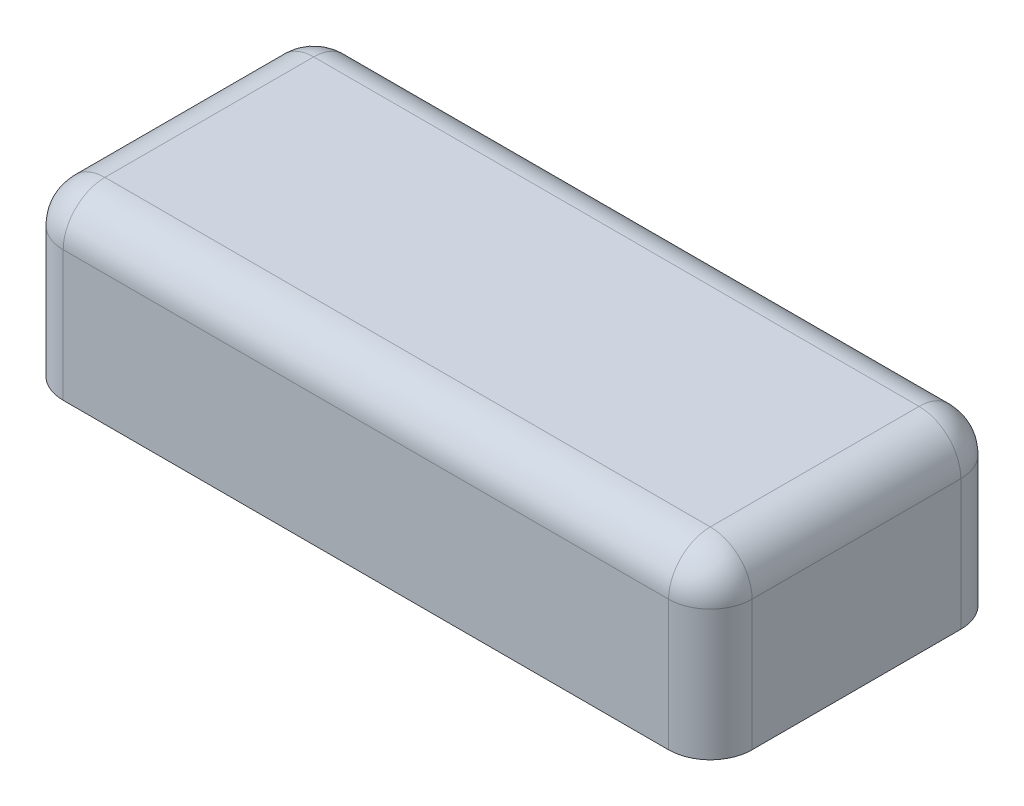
ISO-10303-21;
HEADER;
FILE_DESCRIPTION(('STEP AP214'),'2;1');
FILE_NAME('part.step','',(''),(''),'','','');
FILE_SCHEMA(('AUTOMOTIVE_DESIGN { 1 0 10303 214 1 1 1 1 }'));
ENDSEC;
DATA;
#1=APPLICATION_CONTEXT('core data for automotive mechanical design processes');
#2=APPLICATION_PROTOCOL_DEFINITION('international standard','automotive_design',2000,#1);
#3=PRODUCT_CONTEXT('',#1,'mechanical');
#4=PRODUCT('Part','Part','',(#3));
#5=PRODUCT_RELATED_PRODUCT_CATEGORY('part','',(#4));
#6=PRODUCT_DEFINITION_FORMATION('','',#4);
#7=PRODUCT_DEFINITION_CONTEXT('part definition',#1,'design');
#8=PRODUCT_DEFINITION('design','',#6,#7);
#9=PRODUCT_DEFINITION_SHAPE('','',#8);
#10=(LENGTH_UNIT() NAMED_UNIT(*) SI_UNIT(.MILLI.,.METRE.));
#11=(NAMED_UNIT(*) PLANE_ANGLE_UNIT() SI_UNIT($,.RADIAN.));
#12=(NAMED_UNIT(*) SI_UNIT($,.STERADIAN.) SOLID_ANGLE_UNIT());
#13=UNCERTAINTY_MEASURE_WITH_UNIT(LENGTH_MEASURE(1.E-05),#10,'distance_accuracy_value','');
#14=(GEOMETRIC_REPRESENTATION_CONTEXT(3) GLOBAL_UNCERTAINTY_ASSIGNED_CONTEXT((#13)) GLOBAL_UNIT_ASSIGNED_CONTEXT((#10,
#11,#12)) REPRESENTATION_CONTEXT('',''));
#15=CARTESIAN_POINT('',(0.,0.,0.));
#16=DIRECTION('',(0.,0.,1.));
#17=DIRECTION('',(1.,0.,0.));
#18=AXIS2_PLACEMENT_3D('',#15,#16,#17);
#19=CARTESIAN_POINT('',(0.,6.,0.));
#20=DIRECTION('',(0.,1.,0.));
#21=DIRECTION('',(0.,0.,1.));
#22=AXIS2_PLACEMENT_3D('',#19,#20,#21);
#23=PLANE('',#22);
#24=CARTESIAN_POINT('',(29.,6.,10.));
#25=DIRECTION('',(0.,1.,0.));
#26=DIRECTION('',(0.,0.,1.));
#27=AXIS2_PLACEMENT_3D('',#24,#25,#26);
#28=CIRCLE('',#27,3.50000000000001);
#29=CARTESIAN_POINT('',(29.,6.,6.5));
#30=VERTEX_POINT('',#29);
#31=CARTESIAN_POINT('',(25.5,6.,10.));
#32=VERTEX_POINT('',#31);
#33=EDGE_CURVE('E463',#30,#32,#28,.T.);
#34=ORIENTED_EDGE('',*,*,#33,.T.);
#35=DIRECTION('',(0.,0.,1.));
#36=VECTOR('',#35,1.);
#37=CARTESIAN_POINT('',(25.5,6.,12.5));
#38=LINE('',#37,#36);
#39=CARTESIAN_POINT('',(25.5,6.,12.5));
#40=VERTEX_POINT('',#39);
#41=EDGE_CURVE('E412',#32,#40,#38,.T.);
#42=ORIENTED_EDGE('',*,*,#41,.T.);
#43=DIRECTION('',(1.,0.,0.));
#44=VECTOR('',#43,1.);
#45=CARTESIAN_POINT('',(-31.5,6.,12.5));
#46=LINE('',#45,#44);
#47=CARTESIAN_POINT('',(31.5,6.,12.5));
#48=VERTEX_POINT('',#47);
#49=EDGE_CURVE('E273',#40,#48,#46,.T.);
#50=ORIENTED_EDGE('',*,*,#49,.T.);
#51=DIRECTION('',(0.,0.,-1.));
#52=VECTOR('',#51,1.);
#53=CARTESIAN_POINT('',(31.5,6.,12.5));
#54=LINE('',#53,#52);
#55=CARTESIAN_POINT('',(31.5,6.,6.5));
#56=VERTEX_POINT('',#55);
#57=EDGE_CURVE('E456',#48,#56,#54,.T.);
#58=ORIENTED_EDGE('',*,*,#57,.T.);
#59=DIRECTION('',(-1.,0.,0.));
#60=VECTOR('',#59,1.);
#61=CARTESIAN_POINT('',(29.,6.,6.5));
#62=LINE('',#61,#60);
#63=EDGE_CURVE('E496',#56,#30,#62,.T.);
#64=ORIENTED_EDGE('',*,*,#63,.T.);
#65=EDGE_LOOP('',(#34,#42,#50,#58,#64));
#66=FACE_BOUND('',#65,.T.);
#67=ADVANCED_FACE('F35',(#66),#23,.T.);
#68=CARTESIAN_POINT('',(29.,6.,-10.));
#69=DIRECTION('',(0.,1.,0.));
#70=DIRECTION('',(0.,0.,1.));
#71=AXIS2_PLACEMENT_3D('',#68,#69,#70);
#72=CIRCLE('',#71,3.50000000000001);
#73=CARTESIAN_POINT('',(25.5,6.,-10.));
#74=VERTEX_POINT('',#73);
#75=CARTESIAN_POINT('',(29.,6.,-6.5));
#76=VERTEX_POINT('',#75);
#77=EDGE_CURVE('E488',#74,#76,#72,.T.);
#78=ORIENTED_EDGE('',*,*,#77,.T.);
#79=DIRECTION('',(1.,0.,0.));
#80=VECTOR('',#79,1.);
#81=CARTESIAN_POINT('',(29.,6.,-6.5));
#82=LINE('',#81,#80);
#83=CARTESIAN_POINT('',(31.5,6.,-6.5));
#84=VERTEX_POINT('',#83);
#85=EDGE_CURVE('E491',#76,#84,#82,.T.);
#86=ORIENTED_EDGE('',*,*,#85,.T.);
#87=CARTESIAN_POINT('',(31.5,6.,-12.5));
#88=VERTEX_POINT('',#87);
#89=EDGE_CURVE('E459',#84,#88,#54,.T.);
#90=ORIENTED_EDGE('',*,*,#89,.T.);
#91=DIRECTION('',(-1.,0.,0.));
#92=VECTOR('',#91,1.);
#93=CARTESIAN_POINT('',(-31.5,6.,-12.5));
#94=LINE('',#93,#92);
#95=CARTESIAN_POINT('',(25.5,6.,-12.5));
#96=VERTEX_POINT('',#95);
#97=EDGE_CURVE('E455',#88,#96,#94,.T.);
#98=ORIENTED_EDGE('',*,*,#97,.T.);
#99=DIRECTION('',(0.,0.,1.));
#100=VECTOR('',#99,1.);
#101=CARTESIAN_POINT('',(25.5,6.,-12.5));
#102=LINE('',#101,#100);
#103=EDGE_CURVE('E485',#96,#74,#102,.T.);
#104=ORIENTED_EDGE('',*,*,#103,.T.);
#105=EDGE_LOOP('',(#78,#86,#90,#98,#104));
#106=FACE_BOUND('',#105,.T.);
#107=ADVANCED_FACE('F566',(#106),#23,.T.);
#108=CARTESIAN_POINT('',(-29.,6.,-10.));
#109=DIRECTION('',(0.,1.,0.));
#110=DIRECTION('',(0.,0.,1.));
#111=AXIS2_PLACEMENT_3D('',#108,#109,#110);
#112=CIRCLE('',#111,3.50000000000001);
#113=CARTESIAN_POINT('',(-29.,6.,-6.5));
#114=VERTEX_POINT('',#113);
#115=CARTESIAN_POINT('',(-25.5,6.,-10.));
#116=VERTEX_POINT('',#115);
#117=EDGE_CURVE('E478',#114,#116,#112,.T.);
#118=ORIENTED_EDGE('',*,*,#117,.T.);
#119=DIRECTION('',(0.,0.,-1.));
#120=VECTOR('',#119,1.);
#121=CARTESIAN_POINT('',(-25.5,6.,-12.5));
#122=LINE('',#121,#120);
#123=CARTESIAN_POINT('',(-25.5,6.,-12.5));
#124=VERTEX_POINT('',#123);
#125=EDGE_CURVE('E454',#116,#124,#122,.T.);
#126=ORIENTED_EDGE('',*,*,#125,.T.);
#127=CARTESIAN_POINT('',(-31.5,6.,-12.5));
#128=VERTEX_POINT('',#127);
#129=EDGE_CURVE('E448',#124,#128,#94,.T.);
#130=ORIENTED_EDGE('',*,*,#129,.T.);
#131=DIRECTION('',(0.,0.,1.));
#132=VECTOR('',#131,1.);
#133=CARTESIAN_POINT('',(-31.5,6.,12.5));
#134=LINE('',#133,#132);
#135=CARTESIAN_POINT('',(-31.5,6.,-6.5));
#136=VERTEX_POINT('',#135);
#137=EDGE_CURVE('E278',#128,#136,#134,.T.);
#138=ORIENTED_EDGE('',*,*,#137,.T.);
#139=DIRECTION('',(1.,0.,0.));
#140=VECTOR('',#139,1.);
#141=CARTESIAN_POINT('',(-29.,6.,-6.5));
#142=LINE('',#141,#140);
#143=EDGE_CURVE('E475',#136,#114,#142,.T.);
#144=ORIENTED_EDGE('',*,*,#143,.T.);
#145=EDGE_LOOP('',(#118,#126,#130,#138,#144));
#146=FACE_BOUND('',#145,.T.);
#147=ADVANCED_FACE('F452',(#146),#23,.T.);
#148=CARTESIAN_POINT('',(-29.,6.,9.99999999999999));
#149=DIRECTION('',(0.,1.,0.));
#150=DIRECTION('',(0.,0.,1.));
#151=AXIS2_PLACEMENT_3D('',#148,#149,#150);
#152=CIRCLE('',#151,3.50000000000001);
#153=CARTESIAN_POINT('',(-25.5,6.,10.));
#154=VERTEX_POINT('',#153);
#155=CARTESIAN_POINT('',(-29.,6.,6.49999999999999));
#156=VERTEX_POINT('',#155);
#157=EDGE_CURVE('E467',#154,#156,#152,.T.);
#158=ORIENTED_EDGE('',*,*,#157,.T.);
#159=DIRECTION('',(-1.,0.,0.));
#160=VECTOR('',#159,1.);
#161=CARTESIAN_POINT('',(-29.,6.,6.49999999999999));
#162=LINE('',#161,#160);
#163=CARTESIAN_POINT('',(-31.5,6.,6.49999999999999));
#164=VERTEX_POINT('',#163);
#165=EDGE_CURVE('E470',#156,#164,#162,.T.);
#166=ORIENTED_EDGE('',*,*,#165,.T.);
#167=CARTESIAN_POINT('',(-31.5,6.,12.5));
#168=VERTEX_POINT('',#167);
#169=EDGE_CURVE('E271',#164,#168,#134,.T.);
#170=ORIENTED_EDGE('',*,*,#169,.T.);
#171=CARTESIAN_POINT('',(-25.5,6.,12.5));
#172=VERTEX_POINT('',#171);
#173=EDGE_CURVE('E260',#168,#172,#46,.T.);
#174=ORIENTED_EDGE('',*,*,#173,.T.);
#175=DIRECTION('',(0.,0.,-1.));
#176=VECTOR('',#175,1.);
#177=CARTESIAN_POINT('',(-25.5,6.,12.5));
#178=LINE('',#177,#176);
#179=EDGE_CURVE('E245',#172,#154,#178,.T.);
#180=ORIENTED_EDGE('',*,*,#179,.T.);
#181=EDGE_LOOP('',(#158,#166,#170,#174,#180));
#182=FACE_BOUND('',#181,.T.);
#183=ADVANCED_FACE('F268',(#182),#23,.T.);
#184=CARTESIAN_POINT('',(-31.5,15.,12.5));
#185=DIRECTION('',(1.,0.,0.));
#186=DIRECTION('',(0.,0.,-1.));
#187=AXIS2_PLACEMENT_3D('',#184,#185,#186);
#188=PLANE('',#187);
#189=DIRECTION('',(0.,-1.,0.));
#190=VECTOR('',#189,1.);
#191=CARTESIAN_POINT('',(-31.5,15.,-12.5));
#192=LINE('',#191,#190);
#193=CARTESIAN_POINT('',(-31.5,11.,-12.5));
#194=VERTEX_POINT('',#193);
#195=EDGE_CURVE('E283',#194,#128,#192,.T.);
#196=ORIENTED_EDGE('',*,*,#195,.F.);
#197=DIRECTION('',(0.,0.,1.));
#198=VECTOR('',#197,1.);
#199=CARTESIAN_POINT('',(-31.5,11.,12.5));
#200=LINE('',#199,#198);
#201=CARTESIAN_POINT('',(-31.5,11.,12.5));
#202=VERTEX_POINT('',#201);
#203=EDGE_CURVE('E357',#194,#202,#200,.T.);
#204=ORIENTED_EDGE('',*,*,#203,.T.);
#205=DIRECTION('',(0.,-1.,0.));
#206=VECTOR('',#205,1.);
#207=CARTESIAN_POINT('',(-31.5,15.,12.5));
#208=LINE('',#207,#206);
#209=EDGE_CURVE('E275',#202,#168,#208,.T.);
#210=ORIENTED_EDGE('',*,*,#209,.T.);
#211=ORIENTED_EDGE('',*,*,#169,.F.);
#212=DIRECTION('',(0.,-1.,0.));
#213=VECTOR('',#212,1.);
#214=CARTESIAN_POINT('',(-31.5,16.501,6.49999999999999));
#215=LINE('',#214,#213);
#216=CARTESIAN_POINT('',(-31.5,0.,6.49999999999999));
#217=VERTEX_POINT('',#216);
#218=EDGE_CURVE('E468',#164,#217,#215,.T.);
#219=ORIENTED_EDGE('',*,*,#218,.T.);
#220=DIRECTION('',(0.,0.,-1.));
#221=VECTOR('',#220,1.);
#222=CARTESIAN_POINT('',(-31.5,0.,-6.5));
#223=LINE('',#222,#221);
#224=CARTESIAN_POINT('',(-31.5,0.,-6.5));
#225=VERTEX_POINT('',#224);
#226=EDGE_CURVE('E526',#217,#225,#223,.T.);
#227=ORIENTED_EDGE('',*,*,#226,.T.);
#228=DIRECTION('',(0.,-1.,0.));
#229=VECTOR('',#228,1.);
#230=CARTESIAN_POINT('',(-31.5,16.501,-6.5));
#231=LINE('',#230,#229);
#232=EDGE_CURVE('E471',#136,#225,#231,.T.);
#233=ORIENTED_EDGE('',*,*,#232,.F.);
#234=ORIENTED_EDGE('',*,*,#137,.F.);
#235=EDGE_LOOP('',(#196,#204,#210,#211,#219,#227,#233,#234));
#236=FACE_BOUND('',#235,.T.);
#237=ADVANCED_FACE('F440',(#236),#188,.T.);
#238=CARTESIAN_POINT('',(-31.5,15.,12.5));
#239=DIRECTION('',(0.,0.,-1.));
#240=DIRECTION('',(-1.,0.,0.));
#241=AXIS2_PLACEMENT_3D('',#238,#239,#240);
#242=PLANE('',#241);
#243=ORIENTED_EDGE('',*,*,#209,.F.);
#244=DIRECTION('',(1.,0.,0.));
#245=VECTOR('',#244,1.);
#246=CARTESIAN_POINT('',(-31.5,11.,12.5));
#247=LINE('',#246,#245);
#248=CARTESIAN_POINT('',(31.5,11.,12.5));
#249=VERTEX_POINT('',#248);
#250=EDGE_CURVE('E60',#202,#249,#247,.T.);
#251=ORIENTED_EDGE('',*,*,#250,.T.);
#252=DIRECTION('',(0.,-1.,0.));
#253=VECTOR('',#252,1.);
#254=CARTESIAN_POINT('',(31.5,15.,12.5));
#255=LINE('',#254,#253);
#256=EDGE_CURVE('E272',#249,#48,#255,.T.);
#257=ORIENTED_EDGE('',*,*,#256,.T.);
#258=ORIENTED_EDGE('',*,*,#49,.F.);
#259=DIRECTION('',(0.,-1.,0.));
#260=VECTOR('',#259,1.);
#261=CARTESIAN_POINT('',(25.5,16.501,12.5));
#262=LINE('',#261,#260);
#263=CARTESIAN_POINT('',(25.5,0.,12.5));
#264=VERTEX_POINT('',#263);
#265=EDGE_CURVE('E462',#40,#264,#262,.T.);
#266=ORIENTED_EDGE('',*,*,#265,.T.);
#267=DIRECTION('',(-1.,0.,0.));
#268=VECTOR('',#267,1.);
#269=CARTESIAN_POINT('',(-25.5,0.,12.5));
#270=LINE('',#269,#268);
#271=CARTESIAN_POINT('',(-25.5,0.,12.5));
#272=VERTEX_POINT('',#271);
#273=EDGE_CURVE('E263',#264,#272,#270,.T.);
#274=ORIENTED_EDGE('',*,*,#273,.T.);
#275=DIRECTION('',(0.,-1.,0.));
#276=VECTOR('',#275,1.);
#277=CARTESIAN_POINT('',(-25.5,16.501,12.5));
#278=LINE('',#277,#276);
#279=EDGE_CURVE('E249',#172,#272,#278,.T.);
#280=ORIENTED_EDGE('',*,*,#279,.F.);
#281=ORIENTED_EDGE('',*,*,#173,.F.);
#282=EDGE_LOOP('',(#243,#251,#257,#258,#266,#274,#280,#281));
#283=FACE_BOUND('',#282,.T.);
#284=ADVANCED_FACE('F259',(#283),#242,.T.);
#285=CARTESIAN_POINT('',(31.5,15.,12.5));
#286=DIRECTION('',(-1.,0.,0.));
#287=DIRECTION('',(0.,0.,1.));
#288=AXIS2_PLACEMENT_3D('',#285,#286,#287);
#289=PLANE('',#288);
#290=ORIENTED_EDGE('',*,*,#256,.F.);
#291=DIRECTION('',(0.,0.,-1.));
#292=VECTOR('',#291,1.);
#293=CARTESIAN_POINT('',(31.5,11.,12.5));
#294=LINE('',#293,#292);
#295=CARTESIAN_POINT('',(31.5,11.,-12.5));
#296=VERTEX_POINT('',#295);
#297=EDGE_CURVE('E52',#249,#296,#294,.T.);
#298=ORIENTED_EDGE('',*,*,#297,.T.);
#299=DIRECTION('',(0.,-1.,0.));
#300=VECTOR('',#299,1.);
#301=CARTESIAN_POINT('',(31.5,15.,-12.5));
#302=LINE('',#301,#300);
#303=EDGE_CURVE('E285',#296,#88,#302,.T.);
#304=ORIENTED_EDGE('',*,*,#303,.T.);
#305=ORIENTED_EDGE('',*,*,#89,.F.);
#306=DIRECTION('',(0.,-1.,0.));
#307=VECTOR('',#306,1.);
#308=CARTESIAN_POINT('',(31.5,16.501,-6.5));
#309=LINE('',#308,#307);
#310=CARTESIAN_POINT('',(31.5,0.,-6.5));
#311=VERTEX_POINT('',#310);
#312=EDGE_CURVE('E489',#84,#311,#309,.T.);
#313=ORIENTED_EDGE('',*,*,#312,.T.);
#314=DIRECTION('',(0.,0.,1.));
#315=VECTOR('',#314,1.);
#316=CARTESIAN_POINT('',(31.5,0.,6.5));
#317=LINE('',#316,#315);
#318=CARTESIAN_POINT('',(31.5,0.,6.5));
#319=VERTEX_POINT('',#318);
#320=EDGE_CURVE('E550',#311,#319,#317,.T.);
#321=ORIENTED_EDGE('',*,*,#320,.T.);
#322=DIRECTION('',(0.,-1.,0.));
#323=VECTOR('',#322,1.);
#324=CARTESIAN_POINT('',(31.5,16.501,6.5));
#325=LINE('',#324,#323);
#326=EDGE_CURVE('E492',#56,#319,#325,.T.);
#327=ORIENTED_EDGE('',*,*,#326,.F.);
#328=ORIENTED_EDGE('',*,*,#57,.F.);
#329=EDGE_LOOP('',(#290,#298,#304,#305,#313,#321,#327,#328));
#330=FACE_BOUND('',#329,.T.);
#331=ADVANCED_FACE('F581',(#330),#289,.T.);
#332=CARTESIAN_POINT('',(-31.5,15.,-12.5));
#333=DIRECTION('',(0.,0.,1.));
#334=DIRECTION('',(1.,0.,0.));
#335=AXIS2_PLACEMENT_3D('',#332,#333,#334);
#336=PLANE('',#335);
#337=ORIENTED_EDGE('',*,*,#303,.F.);
#338=DIRECTION('',(-1.,0.,0.));
#339=VECTOR('',#338,1.);
#340=CARTESIAN_POINT('',(-31.5,11.,-12.5));
#341=LINE('',#340,#339);
#342=EDGE_CURVE('E371',#296,#194,#341,.T.);
#343=ORIENTED_EDGE('',*,*,#342,.T.);
#344=ORIENTED_EDGE('',*,*,#195,.T.);
#345=ORIENTED_EDGE('',*,*,#129,.F.);
#346=DIRECTION('',(0.,-1.,0.));
#347=VECTOR('',#346,1.);
#348=CARTESIAN_POINT('',(-25.5,16.501,-12.5));
#349=LINE('',#348,#347);
#350=CARTESIAN_POINT('',(-25.5,0.,-12.5));
#351=VERTEX_POINT('',#350);
#352=EDGE_CURVE('E479',#124,#351,#349,.T.);
#353=ORIENTED_EDGE('',*,*,#352,.T.);
#354=DIRECTION('',(1.,0.,0.));
#355=VECTOR('',#354,1.);
#356=CARTESIAN_POINT('',(25.5,0.,-12.5));
#357=LINE('',#356,#355);
#358=CARTESIAN_POINT('',(25.5,0.,-12.5));
#359=VERTEX_POINT('',#358);
#360=EDGE_CURVE('E538',#351,#359,#357,.T.);
#361=ORIENTED_EDGE('',*,*,#360,.T.);
#362=DIRECTION('',(0.,-1.,0.));
#363=VECTOR('',#362,1.);
#364=CARTESIAN_POINT('',(25.5,16.501,-12.5));
#365=LINE('',#364,#363);
#366=EDGE_CURVE('E481',#96,#359,#365,.T.);
#367=ORIENTED_EDGE('',*,*,#366,.F.);
#368=ORIENTED_EDGE('',*,*,#97,.F.);
#369=EDGE_LOOP('',(#337,#343,#344,#345,#353,#361,#367,#368));
#370=FACE_BOUND('',#369,.T.);
#371=ADVANCED_FACE('F447',(#370),#336,.T.);
#372=CARTESIAN_POINT('',(0.,15.,0.));
#373=DIRECTION('',(0.,1.,0.));
#374=DIRECTION('',(0.,0.,1.));
#375=AXIS2_PLACEMENT_3D('',#372,#373,#374);
#376=PLANE('',#375);
#377=DIRECTION('',(1.,0.,0.));
#378=VECTOR('',#377,1.);
#379=CARTESIAN_POINT('',(0.,15.,8.50000000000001));
#380=LINE('',#379,#378);
#381=CARTESIAN_POINT('',(27.5,15.,8.50000000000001));
#382=VERTEX_POINT('',#381);
#383=CARTESIAN_POINT('',(-27.5,15.,8.50000000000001));
#384=VERTEX_POINT('',#383);
#385=EDGE_CURVE('E364',#382,#384,#380,.F.);
#386=ORIENTED_EDGE('',*,*,#385,.T.);
#387=DIRECTION('',(0.,0.,1.));
#388=VECTOR('',#387,1.);
#389=CARTESIAN_POINT('',(-27.5,15.,0.));
#390=LINE('',#389,#388);
#391=CARTESIAN_POINT('',(-27.5,15.,-8.50000000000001));
#392=VERTEX_POINT('',#391);
#393=EDGE_CURVE('E366',#384,#392,#390,.F.);
#394=ORIENTED_EDGE('',*,*,#393,.T.);
#395=DIRECTION('',(-1.,0.,0.));
#396=VECTOR('',#395,1.);
#397=CARTESIAN_POINT('',(0.,15.,-8.50000000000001));
#398=LINE('',#397,#396);
#399=CARTESIAN_POINT('',(27.5,15.,-8.50000000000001));
#400=VERTEX_POINT('',#399);
#401=EDGE_CURVE('E360',#392,#400,#398,.F.);
#402=ORIENTED_EDGE('',*,*,#401,.T.);
#403=DIRECTION('',(0.,0.,-1.));
#404=VECTOR('',#403,1.);
#405=CARTESIAN_POINT('',(27.5,15.,0.));
#406=LINE('',#405,#404);
#407=EDGE_CURVE('E362',#400,#382,#406,.F.);
#408=ORIENTED_EDGE('',*,*,#407,.T.);
#409=EDGE_LOOP('',(#386,#394,#402,#408));
#410=FACE_BOUND('',#409,.T.);
#411=ADVANCED_FACE('F431',(#410),#376,.F.);
#412=CARTESIAN_POINT('',(25.5,16.501,12.5));
#413=DIRECTION('',(1.,0.,0.));
#414=DIRECTION('',(0.,0.,-1.));
#415=AXIS2_PLACEMENT_3D('',#412,#413,#414);
#416=PLANE('',#415);
#417=DIRECTION('',(0.,-1.,0.));
#418=VECTOR('',#417,1.);
#419=CARTESIAN_POINT('',(25.5,16.501,10.));
#420=LINE('',#419,#418);
#421=CARTESIAN_POINT('',(25.5,0.,10.));
#422=VERTEX_POINT('',#421);
#423=EDGE_CURVE('E497',#32,#422,#420,.T.);
#424=ORIENTED_EDGE('',*,*,#423,.T.);
#425=DIRECTION('',(0.,0.,1.));
#426=VECTOR('',#425,1.);
#427=CARTESIAN_POINT('',(25.5,0.,12.5));
#428=LINE('',#427,#426);
#429=EDGE_CURVE('E265',#422,#264,#428,.T.);
#430=ORIENTED_EDGE('',*,*,#429,.T.);
#431=ORIENTED_EDGE('',*,*,#265,.F.);
#432=ORIENTED_EDGE('',*,*,#41,.F.);
#433=EDGE_LOOP('',(#424,#430,#431,#432));
#434=FACE_BOUND('',#433,.T.);
#435=ADVANCED_FACE('F842',(#434),#416,.F.);
#436=CARTESIAN_POINT('',(29.,16.501,10.));
#437=DIRECTION('',(0.,-1.,0.));
#438=DIRECTION('',(0.,0.,-1.));
#439=AXIS2_PLACEMENT_3D('',#436,#437,#438);
#440=CYLINDRICAL_SURFACE('',#439,3.50000000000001);
#441=DIRECTION('',(0.,-1.,0.));
#442=VECTOR('',#441,1.);
#443=CARTESIAN_POINT('',(29.,16.501,6.5));
#444=LINE('',#443,#442);
#445=CARTESIAN_POINT('',(29.,0.,6.5));
#446=VERTEX_POINT('',#445);
#447=EDGE_CURVE('E494',#30,#446,#444,.T.);
#448=ORIENTED_EDGE('',*,*,#447,.T.);
#449=CARTESIAN_POINT('',(29.,0.,10.));
#450=DIRECTION('',(0.,1.,0.));
#451=DIRECTION('',(0.,0.,-1.));
#452=AXIS2_PLACEMENT_3D('',#449,#450,#451);
#453=CIRCLE('',#452,3.50000000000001);
#454=EDGE_CURVE('E556',#446,#422,#453,.T.);
#455=ORIENTED_EDGE('',*,*,#454,.T.);
#456=ORIENTED_EDGE('',*,*,#423,.F.);
#457=ORIENTED_EDGE('',*,*,#33,.F.);
#458=EDGE_LOOP('',(#448,#455,#456,#457));
#459=FACE_BOUND('',#458,.T.);
#460=ADVANCED_FACE('F833',(#459),#440,.T.);
#461=CARTESIAN_POINT('',(29.,16.501,6.5));
#462=DIRECTION('',(0.,0.,1.));
#463=DIRECTION('',(1.,0.,0.));
#464=AXIS2_PLACEMENT_3D('',#461,#462,#463);
#465=PLANE('',#464);
#466=ORIENTED_EDGE('',*,*,#326,.T.);
#467=DIRECTION('',(-1.,0.,0.));
#468=VECTOR('',#467,1.);
#469=CARTESIAN_POINT('',(29.,0.,6.5));
#470=LINE('',#469,#468);
#471=EDGE_CURVE('E553',#319,#446,#470,.T.);
#472=ORIENTED_EDGE('',*,*,#471,.T.);
#473=ORIENTED_EDGE('',*,*,#447,.F.);
#474=ORIENTED_EDGE('',*,*,#63,.F.);
#475=EDGE_LOOP('',(#466,#472,#473,#474));
#476=FACE_BOUND('',#475,.T.);
#477=ADVANCED_FACE('F590',(#476),#465,.F.);
#478=CARTESIAN_POINT('',(29.,16.501,-6.5));
#479=DIRECTION('',(0.,0.,-1.));
#480=DIRECTION('',(-1.,0.,0.));
#481=AXIS2_PLACEMENT_3D('',#478,#479,#480);
#482=PLANE('',#481);
#483=DIRECTION('',(0.,-1.,0.));
#484=VECTOR('',#483,1.);
#485=CARTESIAN_POINT('',(29.,16.501,-6.5));
#486=LINE('',#485,#484);
#487=CARTESIAN_POINT('',(29.,0.,-6.5));
#488=VERTEX_POINT('',#487);
#489=EDGE_CURVE('E486',#76,#488,#486,.T.);
#490=ORIENTED_EDGE('',*,*,#489,.T.);
#491=DIRECTION('',(1.,0.,0.));
#492=VECTOR('',#491,1.);
#493=CARTESIAN_POINT('',(29.,0.,-6.5));
#494=LINE('',#493,#492);
#495=EDGE_CURVE('E547',#488,#311,#494,.T.);
#496=ORIENTED_EDGE('',*,*,#495,.T.);
#497=ORIENTED_EDGE('',*,*,#312,.F.);
#498=ORIENTED_EDGE('',*,*,#85,.F.);
#499=EDGE_LOOP('',(#490,#496,#497,#498));
#500=FACE_BOUND('',#499,.T.);
#501=ADVANCED_FACE('F579',(#500),#482,.F.);
#502=CARTESIAN_POINT('',(29.,16.501,-10.));
#503=DIRECTION('',(0.,-1.,0.));
#504=DIRECTION('',(0.,0.,-1.));
#505=AXIS2_PLACEMENT_3D('',#502,#503,#504);
#506=CYLINDRICAL_SURFACE('',#505,3.50000000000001);
#507=DIRECTION('',(0.,-1.,0.));
#508=VECTOR('',#507,1.);
#509=CARTESIAN_POINT('',(25.5,16.501,-10.));
#510=LINE('',#509,#508);
#511=CARTESIAN_POINT('',(25.5,0.,-10.));
#512=VERTEX_POINT('',#511);
#513=EDGE_CURVE('E483',#74,#512,#510,.T.);
#514=ORIENTED_EDGE('',*,*,#513,.T.);
#515=CARTESIAN_POINT('',(29.,0.,-10.));
#516=DIRECTION('',(0.,1.,0.));
#517=DIRECTION('',(0.,0.,1.));
#518=AXIS2_PLACEMENT_3D('',#515,#516,#517);
#519=CIRCLE('',#518,3.50000000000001);
#520=EDGE_CURVE('E544',#512,#488,#519,.T.);
#521=ORIENTED_EDGE('',*,*,#520,.T.);
#522=ORIENTED_EDGE('',*,*,#489,.F.);
#523=ORIENTED_EDGE('',*,*,#77,.F.);
#524=EDGE_LOOP('',(#514,#521,#522,#523));
#525=FACE_BOUND('',#524,.T.);
#526=ADVANCED_FACE('F576',(#525),#506,.T.);
#527=CARTESIAN_POINT('',(25.5,16.501,-12.5));
#528=DIRECTION('',(1.,0.,0.));
#529=DIRECTION('',(0.,0.,-1.));
#530=AXIS2_PLACEMENT_3D('',#527,#528,#529);
#531=PLANE('',#530);
#532=ORIENTED_EDGE('',*,*,#366,.T.);
#533=DIRECTION('',(0.,0.,1.));
#534=VECTOR('',#533,1.);
#535=CARTESIAN_POINT('',(25.5,0.,-12.5));
#536=LINE('',#535,#534);
#537=EDGE_CURVE('E541',#359,#512,#536,.T.);
#538=ORIENTED_EDGE('',*,*,#537,.T.);
#539=ORIENTED_EDGE('',*,*,#513,.F.);
#540=ORIENTED_EDGE('',*,*,#103,.F.);
#541=EDGE_LOOP('',(#532,#538,#539,#540));
#542=FACE_BOUND('',#541,.T.);
#543=ADVANCED_FACE('F571',(#542),#531,.F.);
#544=CARTESIAN_POINT('',(-25.5,16.501,-12.5));
#545=DIRECTION('',(-1.,0.,0.));
#546=DIRECTION('',(0.,0.,1.));
#547=AXIS2_PLACEMENT_3D('',#544,#545,#546);
#548=PLANE('',#547);
#549=DIRECTION('',(0.,-1.,0.));
#550=VECTOR('',#549,1.);
#551=CARTESIAN_POINT('',(-25.5,16.501,-10.));
#552=LINE('',#551,#550);
#553=CARTESIAN_POINT('',(-25.5,0.,-10.));
#554=VERTEX_POINT('',#553);
#555=EDGE_CURVE('E476',#116,#554,#552,.T.);
#556=ORIENTED_EDGE('',*,*,#555,.T.);
#557=DIRECTION('',(0.,0.,-1.));
#558=VECTOR('',#557,1.);
#559=CARTESIAN_POINT('',(-25.5,0.,-12.5));
#560=LINE('',#559,#558);
#561=EDGE_CURVE('E535',#554,#351,#560,.T.);
#562=ORIENTED_EDGE('',*,*,#561,.T.);
#563=ORIENTED_EDGE('',*,*,#352,.F.);
#564=ORIENTED_EDGE('',*,*,#125,.F.);
#565=EDGE_LOOP('',(#556,#562,#563,#564));
#566=FACE_BOUND('',#565,.T.);
#567=ADVANCED_FACE('F612',(#566),#548,.F.);
#568=CARTESIAN_POINT('',(-29.,16.501,-10.));
#569=DIRECTION('',(0.,-1.,0.));
#570=DIRECTION('',(0.,0.,-1.));
#571=AXIS2_PLACEMENT_3D('',#568,#569,#570);
#572=CYLINDRICAL_SURFACE('',#571,3.50000000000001);
#573=DIRECTION('',(0.,-1.,0.));
#574=VECTOR('',#573,1.);
#575=CARTESIAN_POINT('',(-29.,16.501,-6.5));
#576=LINE('',#575,#574);
#577=CARTESIAN_POINT('',(-29.,0.,-6.5));
#578=VERTEX_POINT('',#577);
#579=EDGE_CURVE('E473',#114,#578,#576,.T.);
#580=ORIENTED_EDGE('',*,*,#579,.T.);
#581=CARTESIAN_POINT('',(-29.,0.,-10.));
#582=DIRECTION('',(0.,1.,0.));
#583=DIRECTION('',(0.,0.,-1.));
#584=AXIS2_PLACEMENT_3D('',#581,#582,#583);
#585=CIRCLE('',#584,3.50000000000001);
#586=EDGE_CURVE('E532',#578,#554,#585,.T.);
#587=ORIENTED_EDGE('',*,*,#586,.T.);
#588=ORIENTED_EDGE('',*,*,#555,.F.);
#589=ORIENTED_EDGE('',*,*,#117,.F.);
#590=EDGE_LOOP('',(#580,#587,#588,#589));
#591=FACE_BOUND('',#590,.T.);
#592=ADVANCED_FACE('F610',(#591),#572,.T.);
#593=CARTESIAN_POINT('',(-29.,16.501,-6.5));
#594=DIRECTION('',(0.,0.,-1.));
#595=DIRECTION('',(-1.,0.,0.));
#596=AXIS2_PLACEMENT_3D('',#593,#594,#595);
#597=PLANE('',#596);
#598=ORIENTED_EDGE('',*,*,#232,.T.);
#599=DIRECTION('',(1.,0.,0.));
#600=VECTOR('',#599,1.);
#601=CARTESIAN_POINT('',(-29.,0.,-6.5));
#602=LINE('',#601,#600);
#603=EDGE_CURVE('E529',#225,#578,#602,.T.);
#604=ORIENTED_EDGE('',*,*,#603,.T.);
#605=ORIENTED_EDGE('',*,*,#579,.F.);
#606=ORIENTED_EDGE('',*,*,#143,.F.);
#607=EDGE_LOOP('',(#598,#604,#605,#606));
#608=FACE_BOUND('',#607,.T.);
#609=ADVANCED_FACE('F607',(#608),#597,.F.);
#610=CARTESIAN_POINT('',(-29.,16.501,6.49999999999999));
#611=DIRECTION('',(0.,0.,1.));
#612=DIRECTION('',(1.,0.,0.));
#613=AXIS2_PLACEMENT_3D('',#610,#611,#612);
#614=PLANE('',#613);
#615=DIRECTION('',(0.,-1.,0.));
#616=VECTOR('',#615,1.);
#617=CARTESIAN_POINT('',(-29.,16.501,6.49999999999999));
#618=LINE('',#617,#616);
#619=CARTESIAN_POINT('',(-29.,0.,6.49999999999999));
#620=VERTEX_POINT('',#619);
#621=EDGE_CURVE('E256',#156,#620,#618,.T.);
#622=ORIENTED_EDGE('',*,*,#621,.T.);
#623=DIRECTION('',(-1.,0.,0.));
#624=VECTOR('',#623,1.);
#625=CARTESIAN_POINT('',(-29.,0.,6.49999999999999));
#626=LINE('',#625,#624);
#627=EDGE_CURVE('E523',#620,#217,#626,.T.);
#628=ORIENTED_EDGE('',*,*,#627,.T.);
#629=ORIENTED_EDGE('',*,*,#218,.F.);
#630=ORIENTED_EDGE('',*,*,#165,.F.);
#631=EDGE_LOOP('',(#622,#628,#629,#630));
#632=FACE_BOUND('',#631,.T.);
#633=ADVANCED_FACE('F602',(#632),#614,.F.);
#634=CARTESIAN_POINT('',(-29.,16.501,9.99999999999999));
#635=DIRECTION('',(0.,-1.,0.));
#636=DIRECTION('',(0.,0.,-1.));
#637=AXIS2_PLACEMENT_3D('',#634,#635,#636);
#638=CYLINDRICAL_SURFACE('',#637,3.50000000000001);
#639=DIRECTION('',(0.,-1.,0.));
#640=VECTOR('',#639,1.);
#641=CARTESIAN_POINT('',(-25.5,16.501,10.));
#642=LINE('',#641,#640);
#643=CARTESIAN_POINT('',(-25.5,0.,10.));
#644=VERTEX_POINT('',#643);
#645=EDGE_CURVE('E251',#154,#644,#642,.T.);
#646=ORIENTED_EDGE('',*,*,#645,.T.);
#647=CARTESIAN_POINT('',(-29.,0.,9.99999999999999));
#648=DIRECTION('',(0.,1.,0.));
#649=DIRECTION('',(0.,0.,1.));
#650=AXIS2_PLACEMENT_3D('',#647,#648,#649);
#651=CIRCLE('',#650,3.50000000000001);
#652=EDGE_CURVE('E520',#644,#620,#651,.T.);
#653=ORIENTED_EDGE('',*,*,#652,.T.);
#654=ORIENTED_EDGE('',*,*,#621,.F.);
#655=ORIENTED_EDGE('',*,*,#157,.F.);
#656=EDGE_LOOP('',(#646,#653,#654,#655));
#657=FACE_BOUND('',#656,.T.);
#658=ADVANCED_FACE('F599',(#657),#638,.T.);
#659=CARTESIAN_POINT('',(-25.5,16.501,12.5));
#660=DIRECTION('',(-1.,0.,0.));
#661=DIRECTION('',(0.,0.,1.));
#662=AXIS2_PLACEMENT_3D('',#659,#660,#661);
#663=PLANE('',#662);
#664=ORIENTED_EDGE('',*,*,#279,.T.);
#665=DIRECTION('',(0.,0.,-1.));
#666=VECTOR('',#665,1.);
#667=CARTESIAN_POINT('',(-25.5,0.,12.5));
#668=LINE('',#667,#666);
#669=EDGE_CURVE('E518',#272,#644,#668,.T.);
#670=ORIENTED_EDGE('',*,*,#669,.T.);
#671=ORIENTED_EDGE('',*,*,#645,.F.);
#672=ORIENTED_EDGE('',*,*,#179,.F.);
#673=EDGE_LOOP('',(#664,#670,#671,#672));
#674=FACE_BOUND('',#673,.T.);
#675=ADVANCED_FACE('F247',(#674),#663,.F.);
#676=CARTESIAN_POINT('',(0.,0.,0.));
#677=DIRECTION('',(0.,-1.,0.));
#678=DIRECTION('',(0.,0.,-1.));
#679=AXIS2_PLACEMENT_3D('',#676,#677,#678);
#680=PLANE('',#679);
#681=ORIENTED_EDGE('',*,*,#429,.F.);
#682=ORIENTED_EDGE('',*,*,#454,.F.);
#683=ORIENTED_EDGE('',*,*,#471,.F.);
#684=ORIENTED_EDGE('',*,*,#320,.F.);
#685=ORIENTED_EDGE('',*,*,#495,.F.);
#686=ORIENTED_EDGE('',*,*,#520,.F.);
#687=ORIENTED_EDGE('',*,*,#537,.F.);
#688=ORIENTED_EDGE('',*,*,#360,.F.);
#689=ORIENTED_EDGE('',*,*,#561,.F.);
#690=ORIENTED_EDGE('',*,*,#586,.F.);
#691=ORIENTED_EDGE('',*,*,#603,.F.);
#692=ORIENTED_EDGE('',*,*,#226,.F.);
#693=ORIENTED_EDGE('',*,*,#627,.F.);
#694=ORIENTED_EDGE('',*,*,#652,.F.);
#695=ORIENTED_EDGE('',*,*,#669,.F.);
#696=ORIENTED_EDGE('',*,*,#273,.F.);
#697=EDGE_LOOP('',(#681,#682,#683,#684,#685,#686,#687,#688,#689,#690,#691,#692,#693,#694,#695,#696));
#698=FACE_BOUND('',#697,.T.);
#699=CARTESIAN_POINT('',(29.,0.,10.));
#700=DIRECTION('',(0.,1.,0.));
#701=DIRECTION('',(0.,0.,1.));
#702=AXIS2_PLACEMENT_3D('',#699,#700,#701);
#703=CIRCLE('',#702,2.00000000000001);
#704=CARTESIAN_POINT('',(29.,0.,12.));
#705=VERTEX_POINT('',#704);
#706=EDGE_CURVE('E294',#705,#705,#703,.T.);
#707=ORIENTED_EDGE('',*,*,#706,.T.);
#708=EDGE_LOOP('',(#707));
#709=FACE_BOUND('',#708,.T.);
#710=CARTESIAN_POINT('',(-29.,0.,-10.));
#711=DIRECTION('',(0.,1.,0.));
#712=DIRECTION('',(0.,0.,1.));
#713=AXIS2_PLACEMENT_3D('',#710,#711,#712);
#714=CIRCLE('',#713,2.);
#715=CARTESIAN_POINT('',(-29.,0.,-8.));
#716=VERTEX_POINT('',#715);
#717=EDGE_CURVE('E306',#716,#716,#714,.T.);
#718=ORIENTED_EDGE('',*,*,#717,.T.);
#719=EDGE_LOOP('',(#718));
#720=FACE_BOUND('',#719,.T.);
#721=DIRECTION('',(0.,0.,1.));
#722=VECTOR('',#721,1.);
#723=CARTESIAN_POINT('',(-33.,0.,14.));
#724=LINE('',#723,#722);
#725=CARTESIAN_POINT('',(-33.,0.,-10.));
#726=VERTEX_POINT('',#725);
#727=CARTESIAN_POINT('',(-33.,0.,9.99999999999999));
#728=VERTEX_POINT('',#727);
#729=EDGE_CURVE('E317',#726,#728,#724,.T.);
#730=ORIENTED_EDGE('',*,*,#729,.F.);
#731=CARTESIAN_POINT('',(-29.,0.,-10.));
#732=DIRECTION('',(0.,-1.,0.));
#733=DIRECTION('',(0.,0.,-1.));
#734=AXIS2_PLACEMENT_3D('',#731,#732,#733);
#735=CIRCLE('',#734,4.);
#736=CARTESIAN_POINT('',(-29.,0.,-14.));
#737=VERTEX_POINT('',#736);
#738=EDGE_CURVE('E11',#726,#737,#735,.T.);
#739=ORIENTED_EDGE('',*,*,#738,.T.);
#740=DIRECTION('',(-1.,0.,0.));
#741=VECTOR('',#740,1.);
#742=CARTESIAN_POINT('',(-33.,0.,-14.));
#743=LINE('',#742,#741);
#744=CARTESIAN_POINT('',(29.,0.,-14.));
#745=VERTEX_POINT('',#744);
#746=EDGE_CURVE('E314',#745,#737,#743,.T.);
#747=ORIENTED_EDGE('',*,*,#746,.F.);
#748=CARTESIAN_POINT('',(29.,0.,-10.));
#749=DIRECTION('',(0.,-1.,0.));
#750=DIRECTION('',(0.,0.,-1.));
#751=AXIS2_PLACEMENT_3D('',#748,#749,#750);
#752=CIRCLE('',#751,4.);
#753=CARTESIAN_POINT('',(33.,0.,-10.));
#754=VERTEX_POINT('',#753);
#755=EDGE_CURVE('E373',#745,#754,#752,.T.);
#756=ORIENTED_EDGE('',*,*,#755,.T.);
#757=DIRECTION('',(0.,0.,-1.));
#758=VECTOR('',#757,1.);
#759=CARTESIAN_POINT('',(33.,0.,14.));
#760=LINE('',#759,#758);
#761=CARTESIAN_POINT('',(33.,0.,9.99999999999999));
#762=VERTEX_POINT('',#761);
#763=EDGE_CURVE('E311',#762,#754,#760,.T.);
#764=ORIENTED_EDGE('',*,*,#763,.F.);
#765=CARTESIAN_POINT('',(29.,0.,9.99999999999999));
#766=DIRECTION('',(0.,-1.,0.));
#767=DIRECTION('',(0.,0.,-1.));
#768=AXIS2_PLACEMENT_3D('',#765,#766,#767);
#769=CIRCLE('',#768,4.);
#770=CARTESIAN_POINT('',(29.,0.,14.));
#771=VERTEX_POINT('',#770);
#772=EDGE_CURVE('E375',#762,#771,#769,.T.);
#773=ORIENTED_EDGE('',*,*,#772,.T.);
#774=DIRECTION('',(1.,0.,0.));
#775=VECTOR('',#774,1.);
#776=CARTESIAN_POINT('',(-33.,0.,14.));
#777=LINE('',#776,#775);
#778=CARTESIAN_POINT('',(-29.,0.,14.));
#779=VERTEX_POINT('',#778);
#780=EDGE_CURVE('E320',#779,#771,#777,.T.);
#781=ORIENTED_EDGE('',*,*,#780,.F.);
#782=CARTESIAN_POINT('',(-29.,0.,9.99999999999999));
#783=DIRECTION('',(0.,-1.,0.));
#784=DIRECTION('',(0.,0.,-1.));
#785=AXIS2_PLACEMENT_3D('',#782,#783,#784);
#786=CIRCLE('',#785,4.);
#787=EDGE_CURVE('E44',#779,#728,#786,.T.);
#788=ORIENTED_EDGE('',*,*,#787,.T.);
#789=EDGE_LOOP('',(#730,#739,#747,#756,#764,#773,#781,#788));
#790=FACE_BOUND('',#789,.T.);
#791=CARTESIAN_POINT('',(29.,0.,-10.));
#792=DIRECTION('',(0.,1.,0.));
#793=DIRECTION('',(0.,0.,-1.));
#794=AXIS2_PLACEMENT_3D('',#791,#792,#793);
#795=CIRCLE('',#794,2.00000000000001);
#796=CARTESIAN_POINT('',(29.,0.,-12.));
#797=VERTEX_POINT('',#796);
#798=EDGE_CURVE('E301',#797,#797,#795,.T.);
#799=ORIENTED_EDGE('',*,*,#798,.T.);
#800=EDGE_LOOP('',(#799));
#801=FACE_BOUND('',#800,.T.);
#802=CARTESIAN_POINT('',(-29.,0.,10.));
#803=DIRECTION('',(0.,1.,0.));
#804=DIRECTION('',(0.,0.,-1.));
#805=AXIS2_PLACEMENT_3D('',#802,#803,#804);
#806=CIRCLE('',#805,2.);
#807=CARTESIAN_POINT('',(-29.,0.,8.));
#808=VERTEX_POINT('',#807);
#809=EDGE_CURVE('E291',#808,#808,#806,.T.);
#810=ORIENTED_EDGE('',*,*,#809,.T.);
#811=EDGE_LOOP('',(#810));
#812=FACE_BOUND('',#811,.T.);
#813=ADVANCED_FACE('F586',(#698,#709,#720,#790,#801,#812),#680,.T.);
#814=CARTESIAN_POINT('',(33.,5.,14.));
#815=DIRECTION('',(-1.,0.,0.));
#816=DIRECTION('',(0.,0.,1.));
#817=AXIS2_PLACEMENT_3D('',#814,#815,#816);
#818=PLANE('',#817);
#819=DIRECTION('',(0.,0.,-1.));
#820=VECTOR('',#819,1.);
#821=CARTESIAN_POINT('',(33.,12.5,14.));
#822=LINE('',#821,#820);
#823=CARTESIAN_POINT('',(33.,12.5,-10.));
#824=VERTEX_POINT('',#823);
#825=CARTESIAN_POINT('',(33.,12.5,9.99999999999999));
#826=VERTEX_POINT('',#825);
#827=EDGE_CURVE('E334',#824,#826,#822,.F.);
#828=ORIENTED_EDGE('',*,*,#827,.T.);
#829=DIRECTION('',(0.,-1.,0.));
#830=VECTOR('',#829,1.);
#831=CARTESIAN_POINT('',(33.,5.,9.99999999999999));
#832=LINE('',#831,#830);
#833=EDGE_CURVE('E337',#826,#762,#832,.T.);
#834=ORIENTED_EDGE('',*,*,#833,.T.);
#835=ORIENTED_EDGE('',*,*,#763,.T.);
#836=DIRECTION('',(0.,-1.,0.));
#837=VECTOR('',#836,1.);
#838=CARTESIAN_POINT('',(33.,5.,-10.));
#839=LINE('',#838,#837);
#840=EDGE_CURVE('E332',#754,#824,#839,.F.);
#841=ORIENTED_EDGE('',*,*,#840,.T.);
#842=EDGE_LOOP('',(#828,#834,#835,#841));
#843=FACE_BOUND('',#842,.T.);
#844=ADVANCED_FACE('F753',(#843),#818,.F.);
#845=CARTESIAN_POINT('',(-33.,5.,-14.));
#846=DIRECTION('',(0.,0.,1.));
#847=DIRECTION('',(1.,0.,0.));
#848=AXIS2_PLACEMENT_3D('',#845,#846,#847);
#849=PLANE('',#848);
#850=ORIENTED_EDGE('',*,*,#746,.T.);
#851=DIRECTION('',(0.,-1.,0.));
#852=VECTOR('',#851,1.);
#853=CARTESIAN_POINT('',(-29.,5.,-14.));
#854=LINE('',#853,#852);
#855=CARTESIAN_POINT('',(-29.,12.5,-14.));
#856=VERTEX_POINT('',#855);
#857=EDGE_CURVE('E355',#737,#856,#854,.F.);
#858=ORIENTED_EDGE('',*,*,#857,.T.);
#859=DIRECTION('',(-1.,0.,0.));
#860=VECTOR('',#859,1.);
#861=CARTESIAN_POINT('',(33.,12.5,-14.));
#862=LINE('',#861,#860);
#863=CARTESIAN_POINT('',(29.,12.5,-14.));
#864=VERTEX_POINT('',#863);
#865=EDGE_CURVE('E353',#856,#864,#862,.F.);
#866=ORIENTED_EDGE('',*,*,#865,.T.);
#867=DIRECTION('',(0.,-1.,0.));
#868=VECTOR('',#867,1.);
#869=CARTESIAN_POINT('',(29.,5.,-14.));
#870=LINE('',#869,#868);
#871=EDGE_CURVE('E351',#864,#745,#870,.T.);
#872=ORIENTED_EDGE('',*,*,#871,.T.);
#873=EDGE_LOOP('',(#850,#858,#866,#872));
#874=FACE_BOUND('',#873,.T.);
#875=ADVANCED_FACE('F745',(#874),#849,.F.);
#876=CARTESIAN_POINT('',(-33.,5.,14.));
#877=DIRECTION('',(1.,0.,0.));
#878=DIRECTION('',(0.,0.,-1.));
#879=AXIS2_PLACEMENT_3D('',#876,#877,#878);
#880=PLANE('',#879);
#881=DIRECTION('',(0.,0.,1.));
#882=VECTOR('',#881,1.);
#883=CARTESIAN_POINT('',(-33.,12.5,-14.));
#884=LINE('',#883,#882);
#885=CARTESIAN_POINT('',(-33.,12.5,9.99999999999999));
#886=VERTEX_POINT('',#885);
#887=CARTESIAN_POINT('',(-33.,12.5,-10.));
#888=VERTEX_POINT('',#887);
#889=EDGE_CURVE('E347',#886,#888,#884,.F.);
#890=ORIENTED_EDGE('',*,*,#889,.T.);
#891=DIRECTION('',(0.,-1.,0.));
#892=VECTOR('',#891,1.);
#893=CARTESIAN_POINT('',(-33.,5.,-10.));
#894=LINE('',#893,#892);
#895=EDGE_CURVE('E349',#888,#726,#894,.T.);
#896=ORIENTED_EDGE('',*,*,#895,.T.);
#897=ORIENTED_EDGE('',*,*,#729,.T.);
#898=DIRECTION('',(0.,-1.,0.));
#899=VECTOR('',#898,1.);
#900=CARTESIAN_POINT('',(-33.,5.,9.99999999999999));
#901=LINE('',#900,#899);
#902=EDGE_CURVE('E345',#728,#886,#901,.F.);
#903=ORIENTED_EDGE('',*,*,#902,.T.);
#904=EDGE_LOOP('',(#890,#896,#897,#903));
#905=FACE_BOUND('',#904,.T.);
#906=ADVANCED_FACE('F736',(#905),#880,.F.);
#907=CARTESIAN_POINT('',(-33.,5.,14.));
#908=DIRECTION('',(0.,0.,-1.));
#909=DIRECTION('',(-1.,0.,0.));
#910=AXIS2_PLACEMENT_3D('',#907,#908,#909);
#911=PLANE('',#910);
#912=DIRECTION('',(1.,0.,0.));
#913=VECTOR('',#912,1.);
#914=CARTESIAN_POINT('',(-33.,12.5,14.));
#915=LINE('',#914,#913);
#916=CARTESIAN_POINT('',(29.,12.5,14.));
#917=VERTEX_POINT('',#916);
#918=CARTESIAN_POINT('',(-29.,12.5,14.));
#919=VERTEX_POINT('',#918);
#920=EDGE_CURVE('E341',#917,#919,#915,.F.);
#921=ORIENTED_EDGE('',*,*,#920,.T.);
#922=DIRECTION('',(0.,-1.,0.));
#923=VECTOR('',#922,1.);
#924=CARTESIAN_POINT('',(-29.,5.,14.));
#925=LINE('',#924,#923);
#926=EDGE_CURVE('E343',#919,#779,#925,.T.);
#927=ORIENTED_EDGE('',*,*,#926,.T.);
#928=ORIENTED_EDGE('',*,*,#780,.T.);
#929=DIRECTION('',(0.,-1.,0.));
#930=VECTOR('',#929,1.);
#931=CARTESIAN_POINT('',(29.,5.,14.));
#932=LINE('',#931,#930);
#933=EDGE_CURVE('E339',#771,#917,#932,.F.);
#934=ORIENTED_EDGE('',*,*,#933,.T.);
#935=EDGE_LOOP('',(#921,#927,#928,#934));
#936=FACE_BOUND('',#935,.T.);
#937=ADVANCED_FACE('F725',(#936),#911,.F.);
#938=CARTESIAN_POINT('',(-29.,5.,-10.));
#939=DIRECTION('',(0.,-1.,0.));
#940=DIRECTION('',(0.,0.,-1.));
#941=AXIS2_PLACEMENT_3D('',#938,#939,#940);
#942=CYLINDRICAL_SURFACE('',#941,2.);
#943=CARTESIAN_POINT('',(-29.,5.,-10.));
#944=DIRECTION('',(0.,1.,0.));
#945=DIRECTION('',(0.,0.,1.));
#946=AXIS2_PLACEMENT_3D('',#943,#944,#945);
#947=CIRCLE('',#946,2.);
#948=CARTESIAN_POINT('',(-29.,5.,-8.));
#949=VERTEX_POINT('',#948);
#950=EDGE_CURVE('E295',#949,#949,#947,.T.);
#951=ORIENTED_EDGE('',*,*,#950,.T.);
#952=EDGE_LOOP('',(#951));
#953=FACE_BOUND('',#952,.T.);
#954=ORIENTED_EDGE('',*,*,#717,.F.);
#955=EDGE_LOOP('',(#954));
#956=FACE_BOUND('',#955,.T.);
#957=ADVANCED_FACE('F716',(#953,#956),#942,.F.);
#958=CARTESIAN_POINT('',(29.,5.,-10.));
#959=DIRECTION('',(0.,-1.,0.));
#960=DIRECTION('',(0.,0.,-1.));
#961=AXIS2_PLACEMENT_3D('',#958,#959,#960);
#962=CYLINDRICAL_SURFACE('',#961,2.00000000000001);
#963=CARTESIAN_POINT('',(29.,5.,-10.));
#964=DIRECTION('',(0.,1.,0.));
#965=DIRECTION('',(0.,0.,-1.));
#966=AXIS2_PLACEMENT_3D('',#963,#964,#965);
#967=CIRCLE('',#966,2.00000000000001);
#968=CARTESIAN_POINT('',(29.,5.,-12.));
#969=VERTEX_POINT('',#968);
#970=EDGE_CURVE('E298',#969,#969,#967,.T.);
#971=ORIENTED_EDGE('',*,*,#970,.T.);
#972=EDGE_LOOP('',(#971));
#973=FACE_BOUND('',#972,.T.);
#974=ORIENTED_EDGE('',*,*,#798,.F.);
#975=EDGE_LOOP('',(#974));
#976=FACE_BOUND('',#975,.T.);
#977=ADVANCED_FACE('F706',(#973,#976),#962,.F.);
#978=CARTESIAN_POINT('',(29.,5.,10.));
#979=DIRECTION('',(0.,-1.,0.));
#980=DIRECTION('',(0.,0.,-1.));
#981=AXIS2_PLACEMENT_3D('',#978,#979,#980);
#982=CYLINDRICAL_SURFACE('',#981,2.00000000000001);
#983=CARTESIAN_POINT('',(29.,5.,10.));
#984=DIRECTION('',(0.,1.,0.));
#985=DIRECTION('',(0.,0.,1.));
#986=AXIS2_PLACEMENT_3D('',#983,#984,#985);
#987=CIRCLE('',#986,2.00000000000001);
#988=CARTESIAN_POINT('',(29.,5.,12.));
#989=VERTEX_POINT('',#988);
#990=EDGE_CURVE('E290',#989,#989,#987,.T.);
#991=ORIENTED_EDGE('',*,*,#990,.T.);
#992=EDGE_LOOP('',(#991));
#993=FACE_BOUND('',#992,.T.);
#994=ORIENTED_EDGE('',*,*,#706,.F.);
#995=EDGE_LOOP('',(#994));
#996=FACE_BOUND('',#995,.T.);
#997=ADVANCED_FACE('F695',(#993,#996),#982,.F.);
#998=CARTESIAN_POINT('',(-29.,5.,10.));
#999=DIRECTION('',(0.,-1.,0.));
#1000=DIRECTION('',(0.,0.,-1.));
#1001=AXIS2_PLACEMENT_3D('',#998,#999,#1000);
#1002=CYLINDRICAL_SURFACE('',#1001,2.);
#1003=CARTESIAN_POINT('',(-29.,5.,10.));
#1004=DIRECTION('',(0.,1.,0.));
#1005=DIRECTION('',(0.,0.,-1.));
#1006=AXIS2_PLACEMENT_3D('',#1003,#1004,#1005);
#1007=CIRCLE('',#1006,2.);
#1008=CARTESIAN_POINT('',(-29.,5.,8.));
#1009=VERTEX_POINT('',#1008);
#1010=EDGE_CURVE('E287',#1009,#1009,#1007,.T.);
#1011=ORIENTED_EDGE('',*,*,#1010,.T.);
#1012=EDGE_LOOP('',(#1011));
#1013=FACE_BOUND('',#1012,.T.);
#1014=ORIENTED_EDGE('',*,*,#809,.F.);
#1015=EDGE_LOOP('',(#1014));
#1016=FACE_BOUND('',#1015,.T.);
#1017=ADVANCED_FACE('F685',(#1013,#1016),#1002,.F.);
#1018=CARTESIAN_POINT('',(0.,5.,0.));
#1019=DIRECTION('',(0.,1.,0.));
#1020=DIRECTION('',(0.,0.,1.));
#1021=AXIS2_PLACEMENT_3D('',#1018,#1019,#1020);
#1022=PLANE('',#1021);
#1023=ORIENTED_EDGE('',*,*,#1010,.F.);
#1024=EDGE_LOOP('',(#1023));
#1025=FACE_BOUND('',#1024,.T.);
#1026=ADVANCED_FACE('F658',(#1025),#1022,.F.);
#1027=ORIENTED_EDGE('',*,*,#990,.F.);
#1028=EDGE_LOOP('',(#1027));
#1029=FACE_BOUND('',#1028,.T.);
#1030=ADVANCED_FACE('F668',(#1029),#1022,.F.);
#1031=ORIENTED_EDGE('',*,*,#970,.F.);
#1032=EDGE_LOOP('',(#1031));
#1033=FACE_BOUND('',#1032,.T.);
#1034=ADVANCED_FACE('F656',(#1033),#1022,.F.);
#1035=ORIENTED_EDGE('',*,*,#950,.F.);
#1036=EDGE_LOOP('',(#1035));
#1037=FACE_BOUND('',#1036,.T.);
#1038=ADVANCED_FACE('F650',(#1037),#1022,.F.);
#1039=CARTESIAN_POINT('',(0.,16.5,0.));
#1040=DIRECTION('',(0.,1.,0.));
#1041=DIRECTION('',(0.,0.,1.));
#1042=AXIS2_PLACEMENT_3D('',#1039,#1040,#1041);
#1043=PLANE('',#1042);
#1044=DIRECTION('',(1.,0.,0.));
#1045=VECTOR('',#1044,1.);
#1046=CARTESIAN_POINT('',(33.,16.5,9.99999999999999));
#1047=LINE('',#1046,#1045);
#1048=CARTESIAN_POINT('',(-29.,16.5,9.99999999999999));
#1049=VERTEX_POINT('',#1048);
#1050=CARTESIAN_POINT('',(29.,16.5,9.99999999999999));
#1051=VERTEX_POINT('',#1050);
#1052=EDGE_CURVE('E327',#1049,#1051,#1047,.T.);
#1053=ORIENTED_EDGE('',*,*,#1052,.T.);
#1054=DIRECTION('',(0.,0.,-1.));
#1055=VECTOR('',#1054,1.);
#1056=CARTESIAN_POINT('',(29.,16.5,-14.));
#1057=LINE('',#1056,#1055);
#1058=CARTESIAN_POINT('',(29.,16.5,-10.));
#1059=VERTEX_POINT('',#1058);
#1060=EDGE_CURVE('E329',#1051,#1059,#1057,.T.);
#1061=ORIENTED_EDGE('',*,*,#1060,.T.);
#1062=DIRECTION('',(-1.,0.,0.));
#1063=VECTOR('',#1062,1.);
#1064=CARTESIAN_POINT('',(-33.,16.5,-10.));
#1065=LINE('',#1064,#1063);
#1066=CARTESIAN_POINT('',(-29.,16.5,-10.));
#1067=VERTEX_POINT('',#1066);
#1068=EDGE_CURVE('E323',#1059,#1067,#1065,.T.);
#1069=ORIENTED_EDGE('',*,*,#1068,.T.);
#1070=DIRECTION('',(0.,0.,1.));
#1071=VECTOR('',#1070,1.);
#1072=CARTESIAN_POINT('',(-29.,16.5,14.));
#1073=LINE('',#1072,#1071);
#1074=EDGE_CURVE('E325',#1067,#1049,#1073,.T.);
#1075=ORIENTED_EDGE('',*,*,#1074,.T.);
#1076=EDGE_LOOP('',(#1053,#1061,#1069,#1075));
#1077=FACE_BOUND('',#1076,.T.);
#1078=ADVANCED_FACE('F655',(#1077),#1043,.T.);
#1079=CARTESIAN_POINT('',(-29.,5.,9.99999999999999));
#1080=DIRECTION('',(0.,-1.,0.));
#1081=DIRECTION('',(0.,0.,-1.));
#1082=AXIS2_PLACEMENT_3D('',#1079,#1080,#1081);
#1083=CYLINDRICAL_SURFACE('',#1082,4.);
#1084=ORIENTED_EDGE('',*,*,#787,.F.);
#1085=ORIENTED_EDGE('',*,*,#926,.F.);
#1086=CARTESIAN_POINT('',(-29.,12.5,9.99999999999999));
#1087=DIRECTION('',(0.,1.,0.));
#1088=DIRECTION('',(0.,0.,1.));
#1089=AXIS2_PLACEMENT_3D('',#1086,#1087,#1088);
#1090=CIRCLE('',#1089,4.);
#1091=EDGE_CURVE('E409',#886,#919,#1090,.T.);
#1092=ORIENTED_EDGE('',*,*,#1091,.F.);
#1093=ORIENTED_EDGE('',*,*,#902,.F.);
#1094=EDGE_LOOP('',(#1084,#1085,#1092,#1093));
#1095=FACE_BOUND('',#1094,.T.);
#1096=ADVANCED_FACE('F871',(#1095),#1083,.T.);
#1097=CARTESIAN_POINT('',(-29.,12.5,0.));
#1098=DIRECTION('',(0.,0.,-1.));
#1099=DIRECTION('',(-1.,0.,0.));
#1100=AXIS2_PLACEMENT_3D('',#1097,#1098,#1099);
#1101=CYLINDRICAL_SURFACE('',#1100,4.);
#1102=CARTESIAN_POINT('',(-29.,12.5,-10.));
#1103=DIRECTION('',(0.,0.,-1.));
#1104=DIRECTION('',(-1.,0.,0.));
#1105=AXIS2_PLACEMENT_3D('',#1102,#1103,#1104);
#1106=CIRCLE('',#1105,4.);
#1107=EDGE_CURVE('E403',#888,#1067,#1106,.T.);
#1108=ORIENTED_EDGE('',*,*,#1107,.F.);
#1109=ORIENTED_EDGE('',*,*,#889,.F.);
#1110=CARTESIAN_POINT('',(-29.,12.5,9.99999999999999));
#1111=DIRECTION('',(0.,0.,1.));
#1112=DIRECTION('',(1.,0.,0.));
#1113=AXIS2_PLACEMENT_3D('',#1110,#1111,#1112);
#1114=CIRCLE('',#1113,4.);
#1115=EDGE_CURVE('E406',#1049,#886,#1114,.T.);
#1116=ORIENTED_EDGE('',*,*,#1115,.F.);
#1117=ORIENTED_EDGE('',*,*,#1074,.F.);
#1118=EDGE_LOOP('',(#1108,#1109,#1116,#1117));
#1119=FACE_BOUND('',#1118,.T.);
#1120=ADVANCED_FACE('F967',(#1119),#1101,.T.);
#1121=CARTESIAN_POINT('',(-29.,5.,-10.));
#1122=DIRECTION('',(0.,-1.,0.));
#1123=DIRECTION('',(0.,0.,-1.));
#1124=AXIS2_PLACEMENT_3D('',#1121,#1122,#1123);
#1125=CYLINDRICAL_SURFACE('',#1124,4.);
#1126=ORIENTED_EDGE('',*,*,#738,.F.);
#1127=ORIENTED_EDGE('',*,*,#895,.F.);
#1128=CARTESIAN_POINT('',(-29.,12.5,-10.));
#1129=DIRECTION('',(0.,1.,0.));
#1130=DIRECTION('',(0.,0.,1.));
#1131=AXIS2_PLACEMENT_3D('',#1128,#1129,#1130);
#1132=CIRCLE('',#1131,4.);
#1133=EDGE_CURVE('E400',#856,#888,#1132,.T.);
#1134=ORIENTED_EDGE('',*,*,#1133,.F.);
#1135=ORIENTED_EDGE('',*,*,#857,.F.);
#1136=EDGE_LOOP('',(#1126,#1127,#1134,#1135));
#1137=FACE_BOUND('',#1136,.T.);
#1138=ADVANCED_FACE('F977',(#1137),#1125,.T.);
#1139=CARTESIAN_POINT('',(-29.,12.5,9.99999999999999));
#1140=DIRECTION('',(-1.,0.,0.));
#1141=DIRECTION('',(0.,0.,1.));
#1142=AXIS2_PLACEMENT_3D('',#1139,#1140,#1141);
#1143=SPHERICAL_SURFACE('',#1142,4.);
#1144=ORIENTED_EDGE('',*,*,#1115,.T.);
#1145=ORIENTED_EDGE('',*,*,#1091,.T.);
#1146=CARTESIAN_POINT('',(-29.,12.5,9.99999999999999));
#1147=DIRECTION('',(-1.,0.,0.));
#1148=DIRECTION('',(0.,0.,1.));
#1149=AXIS2_PLACEMENT_3D('',#1146,#1147,#1148);
#1150=CIRCLE('',#1149,4.);
#1151=EDGE_CURVE('E397',#1049,#919,#1150,.F.);
#1152=ORIENTED_EDGE('',*,*,#1151,.F.);
#1153=EDGE_LOOP('',(#1144,#1145,#1152));
#1154=FACE_BOUND('',#1153,.T.);
#1155=ADVANCED_FACE('F987',(#1154),#1143,.T.);
#1156=CARTESIAN_POINT('',(-29.,12.5,-10.));
#1157=DIRECTION('',(-1.,0.,0.));
#1158=DIRECTION('',(0.,0.,1.));
#1159=AXIS2_PLACEMENT_3D('',#1156,#1157,#1158);
#1160=SPHERICAL_SURFACE('',#1159,4.);
#1161=ORIENTED_EDGE('',*,*,#1133,.T.);
#1162=ORIENTED_EDGE('',*,*,#1107,.T.);
#1163=CARTESIAN_POINT('',(-29.,12.5,-10.));
#1164=DIRECTION('',(-1.,0.,0.));
#1165=DIRECTION('',(0.,0.,1.));
#1166=AXIS2_PLACEMENT_3D('',#1163,#1164,#1165);
#1167=CIRCLE('',#1166,4.);
#1168=EDGE_CURVE('E394',#856,#1067,#1167,.F.);
#1169=ORIENTED_EDGE('',*,*,#1168,.F.);
#1170=EDGE_LOOP('',(#1161,#1162,#1169));
#1171=FACE_BOUND('',#1170,.T.);
#1172=ADVANCED_FACE('F997',(#1171),#1160,.T.);
#1173=CARTESIAN_POINT('',(29.,5.,9.99999999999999));
#1174=DIRECTION('',(0.,-1.,0.));
#1175=DIRECTION('',(0.,0.,-1.));
#1176=AXIS2_PLACEMENT_3D('',#1173,#1174,#1175);
#1177=CYLINDRICAL_SURFACE('',#1176,4.);
#1178=ORIENTED_EDGE('',*,*,#772,.F.);
#1179=ORIENTED_EDGE('',*,*,#833,.F.);
#1180=CARTESIAN_POINT('',(29.,12.5,9.99999999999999));
#1181=DIRECTION('',(0.,1.,0.));
#1182=DIRECTION('',(0.,0.,1.));
#1183=AXIS2_PLACEMENT_3D('',#1180,#1181,#1182);
#1184=CIRCLE('',#1183,4.);
#1185=EDGE_CURVE('E391',#917,#826,#1184,.T.);
#1186=ORIENTED_EDGE('',*,*,#1185,.F.);
#1187=ORIENTED_EDGE('',*,*,#933,.F.);
#1188=EDGE_LOOP('',(#1178,#1179,#1186,#1187));
#1189=FACE_BOUND('',#1188,.T.);
#1190=ADVANCED_FACE('F1007',(#1189),#1177,.T.);
#1191=CARTESIAN_POINT('',(0.,12.5,9.99999999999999));
#1192=DIRECTION('',(-1.,0.,0.));
#1193=DIRECTION('',(0.,0.,1.));
#1194=AXIS2_PLACEMENT_3D('',#1191,#1192,#1193);
#1195=CYLINDRICAL_SURFACE('',#1194,4.);
#1196=ORIENTED_EDGE('',*,*,#1151,.T.);
#1197=ORIENTED_EDGE('',*,*,#920,.F.);
#1198=CARTESIAN_POINT('',(29.,12.5,9.99999999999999));
#1199=DIRECTION('',(1.,0.,0.));
#1200=DIRECTION('',(0.,0.,-1.));
#1201=AXIS2_PLACEMENT_3D('',#1198,#1199,#1200);
#1202=CIRCLE('',#1201,4.);
#1203=EDGE_CURVE('E388',#1051,#917,#1202,.T.);
#1204=ORIENTED_EDGE('',*,*,#1203,.F.);
#1205=ORIENTED_EDGE('',*,*,#1052,.F.);
#1206=EDGE_LOOP('',(#1196,#1197,#1204,#1205));
#1207=FACE_BOUND('',#1206,.T.);
#1208=ADVANCED_FACE('F1017',(#1207),#1195,.T.);
#1209=CARTESIAN_POINT('',(0.,12.5,-10.));
#1210=DIRECTION('',(1.,0.,0.));
#1211=DIRECTION('',(0.,0.,-1.));
#1212=AXIS2_PLACEMENT_3D('',#1209,#1210,#1211);
#1213=CYLINDRICAL_SURFACE('',#1212,4.);
#1214=ORIENTED_EDGE('',*,*,#1168,.T.);
#1215=ORIENTED_EDGE('',*,*,#1068,.F.);
#1216=CARTESIAN_POINT('',(29.,12.5,-10.));
#1217=DIRECTION('',(1.,0.,0.));
#1218=DIRECTION('',(0.,1.,0.));
#1219=AXIS2_PLACEMENT_3D('',#1216,#1217,#1218);
#1220=CIRCLE('',#1219,4.);
#1221=EDGE_CURVE('E385',#864,#1059,#1220,.T.);
#1222=ORIENTED_EDGE('',*,*,#1221,.F.);
#1223=ORIENTED_EDGE('',*,*,#865,.F.);
#1224=EDGE_LOOP('',(#1214,#1215,#1222,#1223));
#1225=FACE_BOUND('',#1224,.T.);
#1226=ADVANCED_FACE('F1027',(#1225),#1213,.T.);
#1227=CARTESIAN_POINT('',(29.,5.,-10.));
#1228=DIRECTION('',(0.,-1.,0.));
#1229=DIRECTION('',(0.,0.,-1.));
#1230=AXIS2_PLACEMENT_3D('',#1227,#1228,#1229);
#1231=CYLINDRICAL_SURFACE('',#1230,4.);
#1232=ORIENTED_EDGE('',*,*,#755,.F.);
#1233=ORIENTED_EDGE('',*,*,#871,.F.);
#1234=CARTESIAN_POINT('',(29.,12.5,-10.));
#1235=DIRECTION('',(0.,1.,0.));
#1236=DIRECTION('',(0.,0.,1.));
#1237=AXIS2_PLACEMENT_3D('',#1234,#1235,#1236);
#1238=CIRCLE('',#1237,4.);
#1239=EDGE_CURVE('E382',#824,#864,#1238,.T.);
#1240=ORIENTED_EDGE('',*,*,#1239,.F.);
#1241=ORIENTED_EDGE('',*,*,#840,.F.);
#1242=EDGE_LOOP('',(#1232,#1233,#1240,#1241));
#1243=FACE_BOUND('',#1242,.T.);
#1244=ADVANCED_FACE('F1037',(#1243),#1231,.T.);
#1245=CARTESIAN_POINT('',(29.,12.5,9.99999999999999));
#1246=DIRECTION('',(0.,0.,1.));
#1247=DIRECTION('',(1.,0.,0.));
#1248=AXIS2_PLACEMENT_3D('',#1245,#1246,#1247);
#1249=SPHERICAL_SURFACE('',#1248,4.);
#1250=ORIENTED_EDGE('',*,*,#1203,.T.);
#1251=ORIENTED_EDGE('',*,*,#1185,.T.);
#1252=CARTESIAN_POINT('',(29.,12.5,9.99999999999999));
#1253=DIRECTION('',(0.,0.,1.));
#1254=DIRECTION('',(1.,0.,0.));
#1255=AXIS2_PLACEMENT_3D('',#1252,#1253,#1254);
#1256=CIRCLE('',#1255,4.);
#1257=EDGE_CURVE('E380',#1051,#826,#1256,.F.);
#1258=ORIENTED_EDGE('',*,*,#1257,.F.);
#1259=EDGE_LOOP('',(#1250,#1251,#1258));
#1260=FACE_BOUND('',#1259,.T.);
#1261=ADVANCED_FACE('F1047',(#1260),#1249,.T.);
#1262=CARTESIAN_POINT('',(29.,12.5,-10.));
#1263=DIRECTION('',(0.,0.,-1.));
#1264=DIRECTION('',(-1.,0.,0.));
#1265=AXIS2_PLACEMENT_3D('',#1262,#1263,#1264);
#1266=SPHERICAL_SURFACE('',#1265,4.);
#1267=ORIENTED_EDGE('',*,*,#1239,.T.);
#1268=ORIENTED_EDGE('',*,*,#1221,.T.);
#1269=CARTESIAN_POINT('',(29.,12.5,-10.));
#1270=DIRECTION('',(0.,0.,-1.));
#1271=DIRECTION('',(-1.,0.,0.));
#1272=AXIS2_PLACEMENT_3D('',#1269,#1270,#1271);
#1273=CIRCLE('',#1272,4.);
#1274=EDGE_CURVE('E378',#824,#1059,#1273,.F.);
#1275=ORIENTED_EDGE('',*,*,#1274,.F.);
#1276=EDGE_LOOP('',(#1267,#1268,#1275));
#1277=FACE_BOUND('',#1276,.T.);
#1278=ADVANCED_FACE('F1057',(#1277),#1266,.T.);
#1279=CARTESIAN_POINT('',(29.,12.5,0.));
#1280=DIRECTION('',(0.,0.,1.));
#1281=DIRECTION('',(1.,0.,0.));
#1282=AXIS2_PLACEMENT_3D('',#1279,#1280,#1281);
#1283=CYLINDRICAL_SURFACE('',#1282,4.);
#1284=ORIENTED_EDGE('',*,*,#1257,.T.);
#1285=ORIENTED_EDGE('',*,*,#827,.F.);
#1286=ORIENTED_EDGE('',*,*,#1274,.T.);
#1287=ORIENTED_EDGE('',*,*,#1060,.F.);
#1288=EDGE_LOOP('',(#1284,#1285,#1286,#1287));
#1289=FACE_BOUND('',#1288,.T.);
#1290=ADVANCED_FACE('F1067',(#1289),#1283,.T.);
#1291=CARTESIAN_POINT('',(27.5,11.,12.5));
#1292=DIRECTION('',(0.,0.,-1.));
#1293=DIRECTION('',(-1.,0.,0.));
#1294=AXIS2_PLACEMENT_3D('',#1291,#1292,#1293);
#1295=CYLINDRICAL_SURFACE('',#1294,4.);
#1296=CARTESIAN_POINT('',(27.5,11.,8.50000000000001));
#1297=DIRECTION('',(0.707106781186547,0.,-0.707106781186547));
#1298=DIRECTION('',(0.707106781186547,0.,0.707106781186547));
#1299=AXIS2_PLACEMENT_3D('',#1296,#1297,#1298);
#1300=ELLIPSE('',#1299,5.65685424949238,4.);
#1301=EDGE_CURVE('E416',#382,#249,#1300,.T.);
#1302=ORIENTED_EDGE('',*,*,#1301,.F.);
#1303=ORIENTED_EDGE('',*,*,#407,.F.);
#1304=CARTESIAN_POINT('',(27.5,11.,-8.5));
#1305=DIRECTION('',(-0.707106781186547,0.,-0.707106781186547));
#1306=DIRECTION('',(0.707106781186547,0.,-0.707106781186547));
#1307=AXIS2_PLACEMENT_3D('',#1304,#1305,#1306);
#1308=ELLIPSE('',#1307,5.65685424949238,4.);
#1309=EDGE_CURVE('E39',#296,#400,#1308,.F.);
#1310=ORIENTED_EDGE('',*,*,#1309,.F.);
#1311=ORIENTED_EDGE('',*,*,#297,.F.);
#1312=EDGE_LOOP('',(#1302,#1303,#1310,#1311));
#1313=FACE_BOUND('',#1312,.T.);
#1314=ADVANCED_FACE('F37',(#1313),#1295,.F.);
#1315=CARTESIAN_POINT('',(-31.5,11.,-8.50000000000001));
#1316=DIRECTION('',(-1.,0.,0.));
#1317=DIRECTION('',(0.,0.,1.));
#1318=AXIS2_PLACEMENT_3D('',#1315,#1316,#1317);
#1319=CYLINDRICAL_SURFACE('',#1318,4.);
#1320=ORIENTED_EDGE('',*,*,#1309,.T.);
#1321=ORIENTED_EDGE('',*,*,#401,.F.);
#1322=CARTESIAN_POINT('',(-27.5,11.,-8.5));
#1323=DIRECTION('',(-0.707106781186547,0.,0.707106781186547));
#1324=DIRECTION('',(0.707106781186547,0.,0.707106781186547));
#1325=AXIS2_PLACEMENT_3D('',#1322,#1323,#1324);
#1326=ELLIPSE('',#1325,5.65685424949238,4.);
#1327=EDGE_CURVE('E415',#194,#392,#1326,.F.);
#1328=ORIENTED_EDGE('',*,*,#1327,.F.);
#1329=ORIENTED_EDGE('',*,*,#342,.F.);
#1330=EDGE_LOOP('',(#1320,#1321,#1328,#1329));
#1331=FACE_BOUND('',#1330,.T.);
#1332=ADVANCED_FACE('F426',(#1331),#1319,.F.);
#1333=CARTESIAN_POINT('',(-31.5,11.,8.50000000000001));
#1334=DIRECTION('',(1.,0.,0.));
#1335=DIRECTION('',(0.,0.,-1.));
#1336=AXIS2_PLACEMENT_3D('',#1333,#1334,#1335);
#1337=CYLINDRICAL_SURFACE('',#1336,4.);
#1338=ORIENTED_EDGE('',*,*,#1301,.T.);
#1339=ORIENTED_EDGE('',*,*,#250,.F.);
#1340=CARTESIAN_POINT('',(-27.5,11.,8.50000000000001));
#1341=DIRECTION('',(0.707106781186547,0.,0.707106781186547));
#1342=DIRECTION('',(-0.707106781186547,0.,0.707106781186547));
#1343=AXIS2_PLACEMENT_3D('',#1340,#1341,#1342);
#1344=ELLIPSE('',#1343,5.65685424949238,4.);
#1345=EDGE_CURVE('E413',#384,#202,#1344,.T.);
#1346=ORIENTED_EDGE('',*,*,#1345,.F.);
#1347=ORIENTED_EDGE('',*,*,#385,.F.);
#1348=EDGE_LOOP('',(#1338,#1339,#1346,#1347));
#1349=FACE_BOUND('',#1348,.T.);
#1350=ADVANCED_FACE('F437',(#1349),#1337,.F.);
#1351=CARTESIAN_POINT('',(-27.5,11.,12.5));
#1352=DIRECTION('',(0.,0.,1.));
#1353=DIRECTION('',(1.,0.,0.));
#1354=AXIS2_PLACEMENT_3D('',#1351,#1352,#1353);
#1355=CYLINDRICAL_SURFACE('',#1354,4.);
#1356=ORIENTED_EDGE('',*,*,#1327,.T.);
#1357=ORIENTED_EDGE('',*,*,#393,.F.);
#1358=ORIENTED_EDGE('',*,*,#1345,.T.);
#1359=ORIENTED_EDGE('',*,*,#203,.F.);
#1360=EDGE_LOOP('',(#1356,#1357,#1358,#1359));
#1361=FACE_BOUND('',#1360,.T.);
#1362=ADVANCED_FACE('F435',(#1361),#1355,.F.);
#1363=CLOSED_SHELL('',(#67,#107,#147,#183,#237,#284,#331,#371,#411,#435,#460,#477,#501,#526,
#543,#567,#592,#609,#633,#658,#675,#813,#844,#875,#906,#937,#957,#977,#997,#1017,#1026,#1030,
#1034,#1038,#1078,#1096,#1120,#1138,#1155,#1172,#1190,#1208,#1226,#1244,#1261,#1278,#1290,#1314,
#1332,#1350,#1362));
#1364=MANIFOLD_SOLID_BREP('B2',#1363);
#1365=ADVANCED_BREP_SHAPE_REPRESENTATION('',(#18,#1364),#14);
#1366=SHAPE_DEFINITION_REPRESENTATION(#9,#1365);
ENDSEC;
END-ISO-10303-21;
